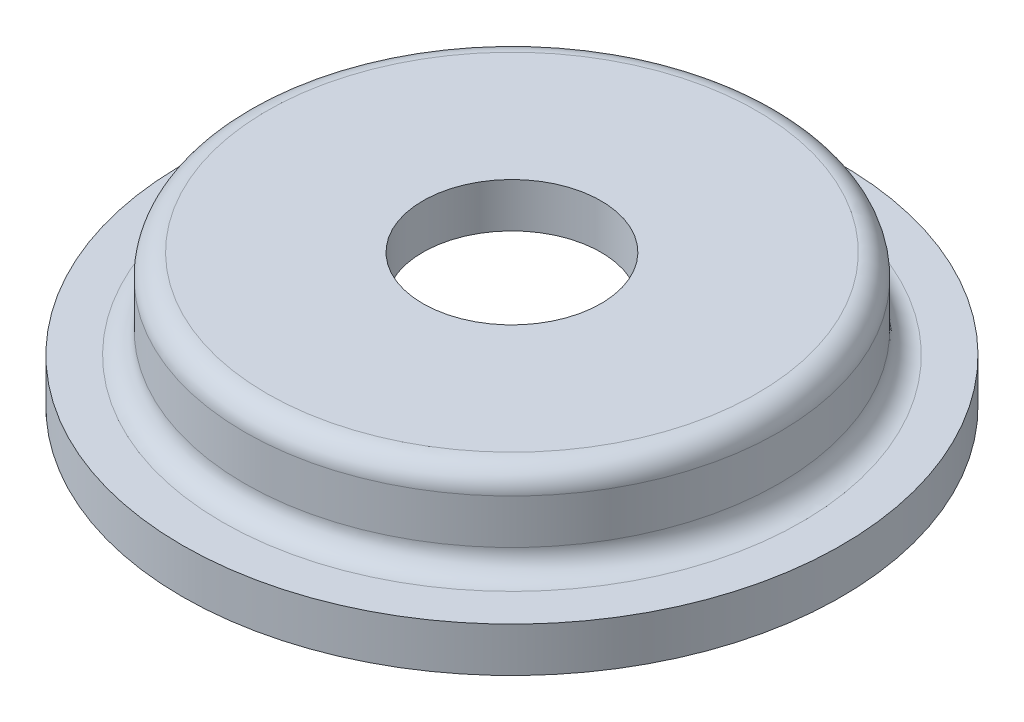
from build123d import *


with BuildPart() as part:
    # Esquisse1 → R_volution1 (revolve)
    with BuildSketch(Plane.XY, mode=Mode.PRIVATE) as r_volution1_sk:
        with BuildLine():
            Line((-7.4, 0), (-7.4, 1))
            Line((-7.4, 1), (-6.5, 1))
            ThreePointArc((-6.5, 1), (-6.146446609, 1.146446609), (-6, 1.5))
            Line((-6, 1.5), (-6, 2.5))
            ThreePointArc((-6, 2.5), (-5.853553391, 2.853553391), (-5.5, 3))
            Line((-5.5, 3), (-2, 3))
            Line((-2, 3), (-2, 2))
            Line((-2, 2), (-4.5, 2))
            ThreePointArc((-4.5, 2), (-4.853553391, 1.853553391), (-5, 1.5))
            Line((-5, 1.5), (-5, 0.5))
            ThreePointArc((-5, 0.5), (-5.146446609, 0.146446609), (-5.5, 0))
            Line((-5.5, 0), (-7.4, 0))
        make_face()
    revolve(r_volution1_sk.sketch.rotate(Axis((0, 7.144789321, 0), (0, -1, 0)), 270), axis=Axis((0, 7.144789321, 0), (0, -1, 0)))


solid = part.part
